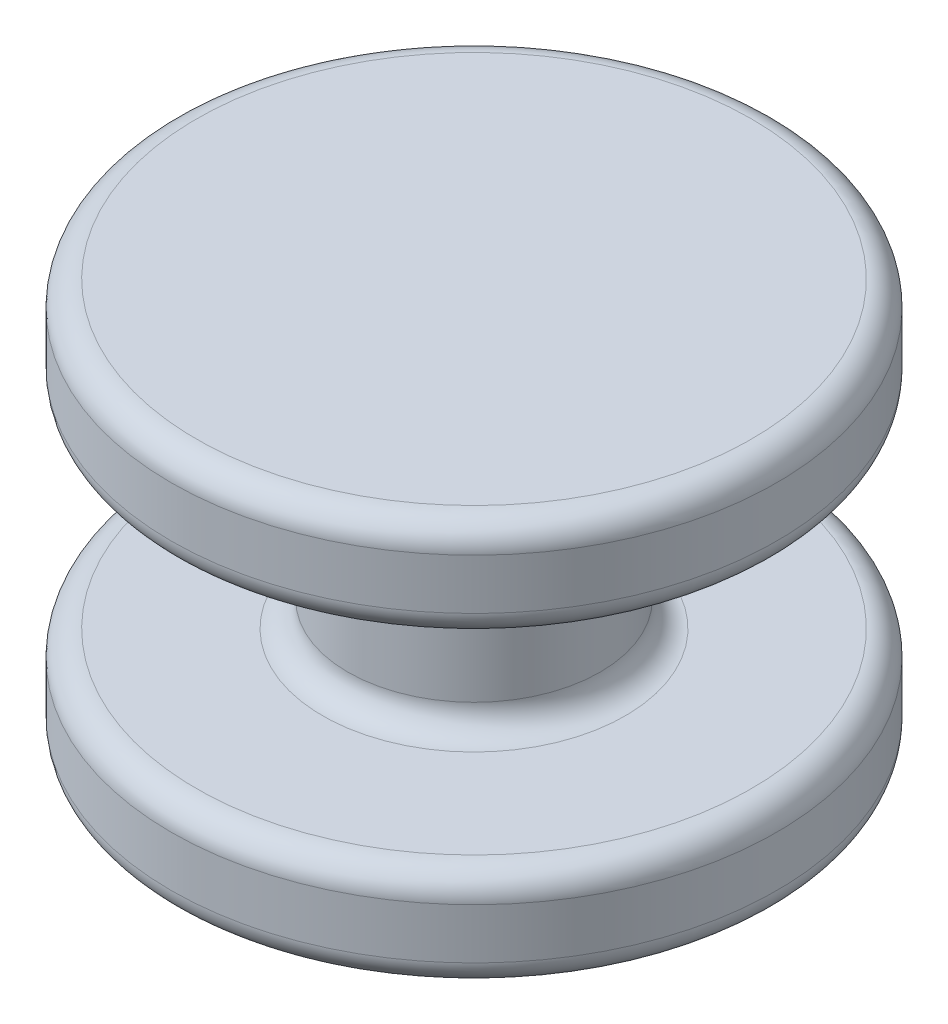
ISO-10303-21;
HEADER;
FILE_DESCRIPTION(('STEP AP214'),'2;1');
FILE_NAME('part.step','',(''),(''),'','','');
FILE_SCHEMA(('AUTOMOTIVE_DESIGN { 1 0 10303 214 1 1 1 1 }'));
ENDSEC;
DATA;
#1=APPLICATION_CONTEXT('core data for automotive mechanical design processes');
#2=APPLICATION_PROTOCOL_DEFINITION('international standard','automotive_design',2000,#1);
#3=PRODUCT_CONTEXT('',#1,'mechanical');
#4=PRODUCT('Part','Part','',(#3));
#5=PRODUCT_RELATED_PRODUCT_CATEGORY('part','',(#4));
#6=PRODUCT_DEFINITION_FORMATION('','',#4);
#7=PRODUCT_DEFINITION_CONTEXT('part definition',#1,'design');
#8=PRODUCT_DEFINITION('design','',#6,#7);
#9=PRODUCT_DEFINITION_SHAPE('','',#8);
#10=(LENGTH_UNIT() NAMED_UNIT(*) SI_UNIT(.MILLI.,.METRE.));
#11=(NAMED_UNIT(*) PLANE_ANGLE_UNIT() SI_UNIT($,.RADIAN.));
#12=(NAMED_UNIT(*) SI_UNIT($,.STERADIAN.) SOLID_ANGLE_UNIT());
#13=UNCERTAINTY_MEASURE_WITH_UNIT(LENGTH_MEASURE(1.E-05),#10,'distance_accuracy_value','');
#14=(GEOMETRIC_REPRESENTATION_CONTEXT(3) GLOBAL_UNCERTAINTY_ASSIGNED_CONTEXT((#13)) GLOBAL_UNIT_ASSIGNED_CONTEXT((#10,
#11,#12)) REPRESENTATION_CONTEXT('',''));
#15=CARTESIAN_POINT('',(0.,0.,0.));
#16=DIRECTION('',(0.,0.,1.));
#17=DIRECTION('',(1.,0.,0.));
#18=AXIS2_PLACEMENT_3D('',#15,#16,#17);
#19=CARTESIAN_POINT('',(0.,4.,0.));
#20=DIRECTION('',(0.,1.,0.));
#21=DIRECTION('',(0.,0.,1.));
#22=AXIS2_PLACEMENT_3D('',#19,#20,#21);
#23=PLANE('',#22);
#24=CARTESIAN_POINT('',(0.,4.,0.));
#25=DIRECTION('',(0.,-1.,0.));
#26=DIRECTION('',(0.,0.,-1.));
#27=AXIS2_PLACEMENT_3D('',#24,#25,#26);
#28=CIRCLE('',#27,5.5);
#29=CARTESIAN_POINT('',(0.,4.,-5.5));
#30=VERTEX_POINT('',#29);
#31=EDGE_CURVE('E10',#30,#30,#28,.T.);
#32=ORIENTED_EDGE('',*,*,#31,.F.);
#33=EDGE_LOOP('',(#32));
#34=FACE_BOUND('',#33,.T.);
#35=ADVANCED_FACE('F29',(#34),#23,.T.);
#36=CARTESIAN_POINT('',(0.,3.5,0.));
#37=DIRECTION('',(0.,-1.,0.));
#38=DIRECTION('',(0.,0.,-1.));
#39=AXIS2_PLACEMENT_3D('',#36,#37,#38);
#40=TOROIDAL_SURFACE('',#39,5.5,0.5);
#41=ORIENTED_EDGE('',*,*,#31,.T.);
#42=EDGE_LOOP('',(#41));
#43=FACE_BOUND('',#42,.T.);
#44=CARTESIAN_POINT('',(0.,3.5,0.));
#45=DIRECTION('',(0.,-1.,0.));
#46=DIRECTION('',(0.,0.,-1.));
#47=AXIS2_PLACEMENT_3D('',#44,#45,#46);
#48=CIRCLE('',#47,6.);
#49=CARTESIAN_POINT('',(0.,3.5,-6.));
#50=VERTEX_POINT('',#49);
#51=EDGE_CURVE('E35',#50,#50,#48,.T.);
#52=ORIENTED_EDGE('',*,*,#51,.F.);
#53=EDGE_LOOP('',(#52));
#54=FACE_BOUND('',#53,.T.);
#55=ADVANCED_FACE('F89',(#43,#54),#40,.T.);
#56=CARTESIAN_POINT('',(0.,-4.,0.));
#57=DIRECTION('',(0.,-1.,0.));
#58=DIRECTION('',(0.,0.,-1.));
#59=AXIS2_PLACEMENT_3D('',#56,#57,#58);
#60=CYLINDRICAL_SURFACE('',#59,6.);
#61=ORIENTED_EDGE('',*,*,#51,.T.);
#62=EDGE_LOOP('',(#61));
#63=FACE_BOUND('',#62,.T.);
#64=CARTESIAN_POINT('',(0.,2.5,0.));
#65=DIRECTION('',(0.,-1.,0.));
#66=DIRECTION('',(0.,0.,-1.));
#67=AXIS2_PLACEMENT_3D('',#64,#65,#66);
#68=CIRCLE('',#67,6.);
#69=CARTESIAN_POINT('',(0.,2.5,-6.));
#70=VERTEX_POINT('',#69);
#71=EDGE_CURVE('E39',#70,#70,#68,.T.);
#72=ORIENTED_EDGE('',*,*,#71,.F.);
#73=EDGE_LOOP('',(#72));
#74=FACE_BOUND('',#73,.T.);
#75=ADVANCED_FACE('F94',(#63,#74),#60,.T.);
#76=CARTESIAN_POINT('',(0.,2.5,0.));
#77=DIRECTION('',(0.,-1.,0.));
#78=DIRECTION('',(0.,0.,-1.));
#79=AXIS2_PLACEMENT_3D('',#76,#77,#78);
#80=TOROIDAL_SURFACE('',#79,5.5,0.5);
#81=ORIENTED_EDGE('',*,*,#71,.T.);
#82=EDGE_LOOP('',(#81));
#83=FACE_BOUND('',#82,.T.);
#84=CARTESIAN_POINT('',(0.,2.,0.));
#85=DIRECTION('',(0.,-1.,0.));
#86=DIRECTION('',(0.,0.,-1.));
#87=AXIS2_PLACEMENT_3D('',#84,#85,#86);
#88=CIRCLE('',#87,5.5);
#89=CARTESIAN_POINT('',(0.,2.,-5.5));
#90=VERTEX_POINT('',#89);
#91=EDGE_CURVE('E43',#90,#90,#88,.T.);
#92=ORIENTED_EDGE('',*,*,#91,.F.);
#93=EDGE_LOOP('',(#92));
#94=FACE_BOUND('',#93,.T.);
#95=ADVANCED_FACE('F98',(#83,#94),#80,.T.);
#96=CARTESIAN_POINT('',(5.5,2.,0.));
#97=DIRECTION('',(0.,-1.,0.));
#98=DIRECTION('',(0.,0.,-1.));
#99=AXIS2_PLACEMENT_3D('',#96,#97,#98);
#100=PLANE('',#99);
#101=ORIENTED_EDGE('',*,*,#91,.T.);
#102=EDGE_LOOP('',(#101));
#103=FACE_BOUND('',#102,.T.);
#104=CARTESIAN_POINT('',(0.,2.,0.));
#105=DIRECTION('',(0.,-1.,0.));
#106=DIRECTION('',(0.,0.,-1.));
#107=AXIS2_PLACEMENT_3D('',#104,#105,#106);
#108=CIRCLE('',#107,3.);
#109=CARTESIAN_POINT('',(0.,2.,-3.));
#110=VERTEX_POINT('',#109);
#111=EDGE_CURVE('E48',#110,#110,#108,.T.);
#112=ORIENTED_EDGE('',*,*,#111,.F.);
#113=EDGE_LOOP('',(#112));
#114=FACE_BOUND('',#113,.T.);
#115=ADVANCED_FACE('F104',(#103,#114),#100,.T.);
#116=CARTESIAN_POINT('',(0.,1.5,0.));
#117=DIRECTION('',(0.,-1.,0.));
#118=DIRECTION('',(0.,0.,-1.));
#119=AXIS2_PLACEMENT_3D('',#116,#117,#118);
#120=TOROIDAL_SURFACE('',#119,3.,0.5);
#121=ORIENTED_EDGE('',*,*,#111,.T.);
#122=EDGE_LOOP('',(#121));
#123=FACE_BOUND('',#122,.T.);
#124=CARTESIAN_POINT('',(0.,1.5,0.));
#125=DIRECTION('',(0.,-1.,0.));
#126=DIRECTION('',(0.,0.,-1.));
#127=AXIS2_PLACEMENT_3D('',#124,#125,#126);
#128=CIRCLE('',#127,2.5);
#129=CARTESIAN_POINT('',(0.,1.5,-2.5));
#130=VERTEX_POINT('',#129);
#131=EDGE_CURVE('E51',#130,#130,#128,.T.);
#132=ORIENTED_EDGE('',*,*,#131,.F.);
#133=EDGE_LOOP('',(#132));
#134=FACE_BOUND('',#133,.T.);
#135=ADVANCED_FACE('F108',(#123,#134),#120,.F.);
#136=CARTESIAN_POINT('',(0.,-4.,0.));
#137=DIRECTION('',(0.,-1.,0.));
#138=DIRECTION('',(0.,0.,-1.));
#139=AXIS2_PLACEMENT_3D('',#136,#137,#138);
#140=CYLINDRICAL_SURFACE('',#139,2.5);
#141=ORIENTED_EDGE('',*,*,#131,.T.);
#142=EDGE_LOOP('',(#141));
#143=FACE_BOUND('',#142,.T.);
#144=CARTESIAN_POINT('',(0.,-1.5,0.));
#145=DIRECTION('',(0.,-1.,0.));
#146=DIRECTION('',(0.,0.,-1.));
#147=AXIS2_PLACEMENT_3D('',#144,#145,#146);
#148=CIRCLE('',#147,2.5);
#149=CARTESIAN_POINT('',(0.,-1.5,-2.5));
#150=VERTEX_POINT('',#149);
#151=EDGE_CURVE('E54',#150,#150,#148,.T.);
#152=ORIENTED_EDGE('',*,*,#151,.F.);
#153=EDGE_LOOP('',(#152));
#154=FACE_BOUND('',#153,.T.);
#155=ADVANCED_FACE('F112',(#143,#154),#140,.T.);
#156=CARTESIAN_POINT('',(0.,-1.5,0.));
#157=DIRECTION('',(0.,-1.,0.));
#158=DIRECTION('',(0.,0.,-1.));
#159=AXIS2_PLACEMENT_3D('',#156,#157,#158);
#160=TOROIDAL_SURFACE('',#159,3.,0.5);
#161=ORIENTED_EDGE('',*,*,#151,.T.);
#162=EDGE_LOOP('',(#161));
#163=FACE_BOUND('',#162,.T.);
#164=CARTESIAN_POINT('',(0.,-2.,0.));
#165=DIRECTION('',(0.,-1.,0.));
#166=DIRECTION('',(0.,0.,-1.));
#167=AXIS2_PLACEMENT_3D('',#164,#165,#166);
#168=CIRCLE('',#167,3.);
#169=CARTESIAN_POINT('',(0.,-2.,-3.));
#170=VERTEX_POINT('',#169);
#171=EDGE_CURVE('E57',#170,#170,#168,.T.);
#172=ORIENTED_EDGE('',*,*,#171,.F.);
#173=EDGE_LOOP('',(#172));
#174=FACE_BOUND('',#173,.T.);
#175=ADVANCED_FACE('F116',(#163,#174),#160,.F.);
#176=CARTESIAN_POINT('',(5.5,-2.,0.));
#177=DIRECTION('',(0.,1.,0.));
#178=DIRECTION('',(0.,0.,1.));
#179=AXIS2_PLACEMENT_3D('',#176,#177,#178);
#180=PLANE('',#179);
#181=ORIENTED_EDGE('',*,*,#171,.T.);
#182=EDGE_LOOP('',(#181));
#183=FACE_BOUND('',#182,.T.);
#184=CARTESIAN_POINT('',(0.,-2.,0.));
#185=DIRECTION('',(0.,-1.,0.));
#186=DIRECTION('',(0.,0.,-1.));
#187=AXIS2_PLACEMENT_3D('',#184,#185,#186);
#188=CIRCLE('',#187,5.5);
#189=CARTESIAN_POINT('',(0.,-2.,-5.5));
#190=VERTEX_POINT('',#189);
#191=EDGE_CURVE('E60',#190,#190,#188,.T.);
#192=ORIENTED_EDGE('',*,*,#191,.F.);
#193=EDGE_LOOP('',(#192));
#194=FACE_BOUND('',#193,.T.);
#195=ADVANCED_FACE('F120',(#183,#194),#180,.T.);
#196=CARTESIAN_POINT('',(0.,-2.5,0.));
#197=DIRECTION('',(0.,-1.,0.));
#198=DIRECTION('',(0.,0.,-1.));
#199=AXIS2_PLACEMENT_3D('',#196,#197,#198);
#200=TOROIDAL_SURFACE('',#199,5.5,0.5);
#201=ORIENTED_EDGE('',*,*,#191,.T.);
#202=EDGE_LOOP('',(#201));
#203=FACE_BOUND('',#202,.T.);
#204=CARTESIAN_POINT('',(0.,-2.5,0.));
#205=DIRECTION('',(0.,-1.,0.));
#206=DIRECTION('',(0.,0.,-1.));
#207=AXIS2_PLACEMENT_3D('',#204,#205,#206);
#208=CIRCLE('',#207,6.);
#209=CARTESIAN_POINT('',(0.,-2.5,-6.));
#210=VERTEX_POINT('',#209);
#211=EDGE_CURVE('E63',#210,#210,#208,.T.);
#212=ORIENTED_EDGE('',*,*,#211,.F.);
#213=EDGE_LOOP('',(#212));
#214=FACE_BOUND('',#213,.T.);
#215=ADVANCED_FACE('F85',(#203,#214),#200,.T.);
#216=CARTESIAN_POINT('',(0.,-4.,0.));
#217=DIRECTION('',(0.,-1.,0.));
#218=DIRECTION('',(0.,0.,-1.));
#219=AXIS2_PLACEMENT_3D('',#216,#217,#218);
#220=CYLINDRICAL_SURFACE('',#219,6.);
#221=ORIENTED_EDGE('',*,*,#211,.T.);
#222=EDGE_LOOP('',(#221));
#223=FACE_BOUND('',#222,.T.);
#224=CARTESIAN_POINT('',(0.,-3.5,0.));
#225=DIRECTION('',(0.,-1.,0.));
#226=DIRECTION('',(0.,0.,-1.));
#227=AXIS2_PLACEMENT_3D('',#224,#225,#226);
#228=CIRCLE('',#227,6.);
#229=CARTESIAN_POINT('',(0.,-3.5,-6.));
#230=VERTEX_POINT('',#229);
#231=EDGE_CURVE('E66',#230,#230,#228,.T.);
#232=ORIENTED_EDGE('',*,*,#231,.F.);
#233=EDGE_LOOP('',(#232));
#234=FACE_BOUND('',#233,.T.);
#235=ADVANCED_FACE('F77',(#223,#234),#220,.T.);
#236=CARTESIAN_POINT('',(0.,-3.5,0.));
#237=DIRECTION('',(0.,-1.,0.));
#238=DIRECTION('',(0.,0.,-1.));
#239=AXIS2_PLACEMENT_3D('',#236,#237,#238);
#240=TOROIDAL_SURFACE('',#239,5.5,0.5);
#241=ORIENTED_EDGE('',*,*,#231,.T.);
#242=EDGE_LOOP('',(#241));
#243=FACE_BOUND('',#242,.T.);
#244=CARTESIAN_POINT('',(0.,-4.,0.));
#245=DIRECTION('',(0.,-1.,0.));
#246=DIRECTION('',(0.,0.,-1.));
#247=AXIS2_PLACEMENT_3D('',#244,#245,#246);
#248=CIRCLE('',#247,5.5);
#249=CARTESIAN_POINT('',(0.,-4.,-5.5));
#250=VERTEX_POINT('',#249);
#251=EDGE_CURVE('E69',#250,#250,#248,.T.);
#252=ORIENTED_EDGE('',*,*,#251,.F.);
#253=EDGE_LOOP('',(#252));
#254=FACE_BOUND('',#253,.T.);
#255=ADVANCED_FACE('F75',(#243,#254),#240,.T.);
#256=CARTESIAN_POINT('',(0.,-4.,0.));
#257=DIRECTION('',(0.,-1.,0.));
#258=DIRECTION('',(0.,0.,-1.));
#259=AXIS2_PLACEMENT_3D('',#256,#257,#258);
#260=PLANE('',#259);
#261=ORIENTED_EDGE('',*,*,#251,.T.);
#262=EDGE_LOOP('',(#261));
#263=FACE_BOUND('',#262,.T.);
#264=ADVANCED_FACE('F73',(#263),#260,.T.);
#265=CLOSED_SHELL('',(#35,#55,#75,#95,#115,#135,#155,#175,#195,#215,#235,#255,#264));
#266=MANIFOLD_SOLID_BREP('B2',#265);
#267=ADVANCED_BREP_SHAPE_REPRESENTATION('',(#18,#266),#14);
#268=SHAPE_DEFINITION_REPRESENTATION(#9,#267);
ENDSEC;
END-ISO-10303-21;
